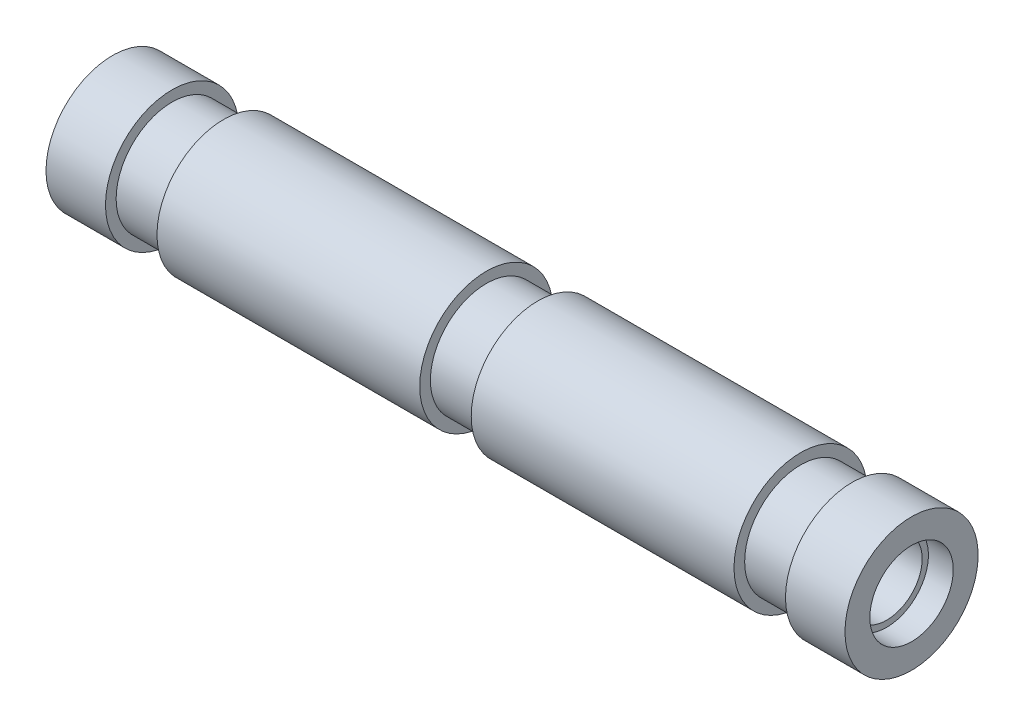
ISO-10303-21;
HEADER;
FILE_DESCRIPTION(('STEP AP214'),'2;1');
FILE_NAME('part.step','',(''),(''),'','','');
FILE_SCHEMA(('AUTOMOTIVE_DESIGN { 1 0 10303 214 1 1 1 1 }'));
ENDSEC;
DATA;
#1=APPLICATION_CONTEXT('core data for automotive mechanical design processes');
#2=APPLICATION_PROTOCOL_DEFINITION('international standard','automotive_design',2000,#1);
#3=PRODUCT_CONTEXT('',#1,'mechanical');
#4=PRODUCT('Part','Part','',(#3));
#5=PRODUCT_RELATED_PRODUCT_CATEGORY('part','',(#4));
#6=PRODUCT_DEFINITION_FORMATION('','',#4);
#7=PRODUCT_DEFINITION_CONTEXT('part definition',#1,'design');
#8=PRODUCT_DEFINITION('design','',#6,#7);
#9=PRODUCT_DEFINITION_SHAPE('','',#8);
#10=(LENGTH_UNIT() NAMED_UNIT(*) SI_UNIT(.MILLI.,.METRE.));
#11=(NAMED_UNIT(*) PLANE_ANGLE_UNIT() SI_UNIT($,.RADIAN.));
#12=(NAMED_UNIT(*) SI_UNIT($,.STERADIAN.) SOLID_ANGLE_UNIT());
#13=UNCERTAINTY_MEASURE_WITH_UNIT(LENGTH_MEASURE(1.E-05),#10,'distance_accuracy_value','');
#14=(GEOMETRIC_REPRESENTATION_CONTEXT(3) GLOBAL_UNCERTAINTY_ASSIGNED_CONTEXT((#13)) GLOBAL_UNIT_ASSIGNED_CONTEXT((#10,
#11,#12)) REPRESENTATION_CONTEXT('',''));
#15=CARTESIAN_POINT('',(0.,0.,0.));
#16=DIRECTION('',(0.,0.,1.));
#17=DIRECTION('',(1.,0.,0.));
#18=AXIS2_PLACEMENT_3D('',#15,#16,#17);
#19=CARTESIAN_POINT('',(-225.,37.5,0.));
#20=DIRECTION('',(1.,0.,0.));
#21=DIRECTION('',(0.,0.,-1.));
#22=AXIS2_PLACEMENT_3D('',#19,#20,#21);
#23=PLANE('',#22);
#24=CARTESIAN_POINT('',(-225.,0.,0.));
#25=DIRECTION('',(-1.,0.,0.));
#26=DIRECTION('',(0.,0.,1.));
#27=AXIS2_PLACEMENT_3D('',#24,#25,#26);
#28=CIRCLE('',#27,23.5);
#29=CARTESIAN_POINT('',(-225.,0.,23.5000000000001));
#30=VERTEX_POINT('',#29);
#31=EDGE_CURVE('E117',#30,#30,#28,.T.);
#32=ORIENTED_EDGE('',*,*,#31,.F.);
#33=EDGE_LOOP('',(#32));
#34=FACE_BOUND('',#33,.T.);
#35=CARTESIAN_POINT('',(-225.,0.,0.));
#36=DIRECTION('',(-1.,0.,0.));
#37=DIRECTION('',(0.,0.,1.));
#38=AXIS2_PLACEMENT_3D('',#35,#36,#37);
#39=CIRCLE('',#38,37.5);
#40=CARTESIAN_POINT('',(-225.,0.,37.5));
#41=VERTEX_POINT('',#40);
#42=EDGE_CURVE('E10',#41,#41,#39,.T.);
#43=ORIENTED_EDGE('',*,*,#42,.T.);
#44=EDGE_LOOP('',(#43));
#45=FACE_BOUND('',#44,.T.);
#46=ADVANCED_FACE('F34',(#34,#45),#23,.F.);
#47=CARTESIAN_POINT('',(-245.901988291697,0.,0.));
#48=DIRECTION('',(-1.,0.,0.));
#49=DIRECTION('',(0.,0.,1.));
#50=AXIS2_PLACEMENT_3D('',#47,#48,#49);
#51=CYLINDRICAL_SURFACE('',#50,37.5);
#52=ORIENTED_EDGE('',*,*,#42,.F.);
#53=EDGE_LOOP('',(#52));
#54=FACE_BOUND('',#53,.T.);
#55=CARTESIAN_POINT('',(-191.5,0.,0.));
#56=DIRECTION('',(-1.,0.,0.));
#57=DIRECTION('',(0.,0.,1.));
#58=AXIS2_PLACEMENT_3D('',#55,#56,#57);
#59=CIRCLE('',#58,37.5);
#60=CARTESIAN_POINT('',(-191.5,0.,37.5));
#61=VERTEX_POINT('',#60);
#62=EDGE_CURVE('E41',#61,#61,#59,.T.);
#63=ORIENTED_EDGE('',*,*,#62,.T.);
#64=EDGE_LOOP('',(#63));
#65=FACE_BOUND('',#64,.T.);
#66=ADVANCED_FACE('F125',(#54,#65),#51,.T.);
#67=CARTESIAN_POINT('',(-191.5,31.5,0.));
#68=DIRECTION('',(-1.,0.,0.));
#69=DIRECTION('',(0.,0.,1.));
#70=AXIS2_PLACEMENT_3D('',#67,#68,#69);
#71=PLANE('',#70);
#72=ORIENTED_EDGE('',*,*,#62,.F.);
#73=EDGE_LOOP('',(#72));
#74=FACE_BOUND('',#73,.T.);
#75=CARTESIAN_POINT('',(-191.5,0.,0.));
#76=DIRECTION('',(-1.,0.,0.));
#77=DIRECTION('',(0.,0.,1.));
#78=AXIS2_PLACEMENT_3D('',#75,#76,#77);
#79=CIRCLE('',#78,31.5);
#80=CARTESIAN_POINT('',(-191.5,0.,31.5));
#81=VERTEX_POINT('',#80);
#82=EDGE_CURVE('E47',#81,#81,#79,.T.);
#83=ORIENTED_EDGE('',*,*,#82,.T.);
#84=EDGE_LOOP('',(#83));
#85=FACE_BOUND('',#84,.T.);
#86=ADVANCED_FACE('F129',(#74,#85),#71,.F.);
#87=CARTESIAN_POINT('',(-245.901988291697,0.,0.));
#88=DIRECTION('',(-1.,0.,0.));
#89=DIRECTION('',(0.,0.,1.));
#90=AXIS2_PLACEMENT_3D('',#87,#88,#89);
#91=CYLINDRICAL_SURFACE('',#90,31.5);
#92=ORIENTED_EDGE('',*,*,#82,.F.);
#93=EDGE_LOOP('',(#92));
#94=FACE_BOUND('',#93,.T.);
#95=CARTESIAN_POINT('',(-162.5,0.,0.));
#96=DIRECTION('',(-1.,0.,0.));
#97=DIRECTION('',(0.,0.,1.));
#98=AXIS2_PLACEMENT_3D('',#95,#96,#97);
#99=CIRCLE('',#98,31.5);
#100=CARTESIAN_POINT('',(-162.5,0.,31.5));
#101=VERTEX_POINT('',#100);
#102=EDGE_CURVE('E53',#101,#101,#99,.T.);
#103=ORIENTED_EDGE('',*,*,#102,.T.);
#104=EDGE_LOOP('',(#103));
#105=FACE_BOUND('',#104,.T.);
#106=ADVANCED_FACE('F134',(#94,#105),#91,.T.);
#107=CARTESIAN_POINT('',(-162.5,37.5,0.));
#108=DIRECTION('',(1.,0.,0.));
#109=DIRECTION('',(0.,0.,-1.));
#110=AXIS2_PLACEMENT_3D('',#107,#108,#109);
#111=PLANE('',#110);
#112=ORIENTED_EDGE('',*,*,#102,.F.);
#113=EDGE_LOOP('',(#112));
#114=FACE_BOUND('',#113,.T.);
#115=CARTESIAN_POINT('',(-162.5,0.,0.));
#116=DIRECTION('',(-1.,0.,0.));
#117=DIRECTION('',(0.,0.,1.));
#118=AXIS2_PLACEMENT_3D('',#115,#116,#117);
#119=CIRCLE('',#118,37.5);
#120=CARTESIAN_POINT('',(-162.5,0.,37.5));
#121=VERTEX_POINT('',#120);
#122=EDGE_CURVE('E59',#121,#121,#119,.T.);
#123=ORIENTED_EDGE('',*,*,#122,.T.);
#124=EDGE_LOOP('',(#123));
#125=FACE_BOUND('',#124,.T.);
#126=ADVANCED_FACE('F140',(#114,#125),#111,.F.);
#127=CARTESIAN_POINT('',(-245.901988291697,0.,0.));
#128=DIRECTION('',(-1.,0.,0.));
#129=DIRECTION('',(0.,0.,1.));
#130=AXIS2_PLACEMENT_3D('',#127,#128,#129);
#131=CYLINDRICAL_SURFACE('',#130,37.5);
#132=ORIENTED_EDGE('',*,*,#122,.F.);
#133=EDGE_LOOP('',(#132));
#134=FACE_BOUND('',#133,.T.);
#135=CARTESIAN_POINT('',(-14.5,0.,0.));
#136=DIRECTION('',(-1.,0.,0.));
#137=DIRECTION('',(0.,0.,1.));
#138=AXIS2_PLACEMENT_3D('',#135,#136,#137);
#139=CIRCLE('',#138,37.5);
#140=CARTESIAN_POINT('',(-14.5,0.,37.5));
#141=VERTEX_POINT('',#140);
#142=EDGE_CURVE('E63',#141,#141,#139,.T.);
#143=ORIENTED_EDGE('',*,*,#142,.T.);
#144=EDGE_LOOP('',(#143));
#145=FACE_BOUND('',#144,.T.);
#146=ADVANCED_FACE('F144',(#134,#145),#131,.T.);
#147=CARTESIAN_POINT('',(-14.5,31.5,0.));
#148=DIRECTION('',(-1.,0.,0.));
#149=DIRECTION('',(0.,0.,1.));
#150=AXIS2_PLACEMENT_3D('',#147,#148,#149);
#151=PLANE('',#150);
#152=ORIENTED_EDGE('',*,*,#142,.F.);
#153=EDGE_LOOP('',(#152));
#154=FACE_BOUND('',#153,.T.);
#155=CARTESIAN_POINT('',(-14.5,0.,0.));
#156=DIRECTION('',(-1.,0.,0.));
#157=DIRECTION('',(0.,0.,1.));
#158=AXIS2_PLACEMENT_3D('',#155,#156,#157);
#159=CIRCLE('',#158,31.5);
#160=CARTESIAN_POINT('',(-14.5,0.,31.5));
#161=VERTEX_POINT('',#160);
#162=EDGE_CURVE('E67',#161,#161,#159,.T.);
#163=ORIENTED_EDGE('',*,*,#162,.T.);
#164=EDGE_LOOP('',(#163));
#165=FACE_BOUND('',#164,.T.);
#166=ADVANCED_FACE('F148',(#154,#165),#151,.F.);
#167=CARTESIAN_POINT('',(-245.901988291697,0.,0.));
#168=DIRECTION('',(-1.,0.,0.));
#169=DIRECTION('',(0.,0.,1.));
#170=AXIS2_PLACEMENT_3D('',#167,#168,#169);
#171=CYLINDRICAL_SURFACE('',#170,31.5);
#172=ORIENTED_EDGE('',*,*,#162,.F.);
#173=EDGE_LOOP('',(#172));
#174=FACE_BOUND('',#173,.T.);
#175=CARTESIAN_POINT('',(14.5,0.,0.));
#176=DIRECTION('',(-1.,0.,0.));
#177=DIRECTION('',(0.,0.,1.));
#178=AXIS2_PLACEMENT_3D('',#175,#176,#177);
#179=CIRCLE('',#178,31.5);
#180=CARTESIAN_POINT('',(14.5,0.,31.5));
#181=VERTEX_POINT('',#180);
#182=EDGE_CURVE('E71',#181,#181,#179,.T.);
#183=ORIENTED_EDGE('',*,*,#182,.T.);
#184=EDGE_LOOP('',(#183));
#185=FACE_BOUND('',#184,.T.);
#186=ADVANCED_FACE('F152',(#174,#185),#171,.T.);
#187=CARTESIAN_POINT('',(14.5,37.5,0.));
#188=DIRECTION('',(1.,0.,0.));
#189=DIRECTION('',(0.,0.,-1.));
#190=AXIS2_PLACEMENT_3D('',#187,#188,#189);
#191=PLANE('',#190);
#192=ORIENTED_EDGE('',*,*,#182,.F.);
#193=EDGE_LOOP('',(#192));
#194=FACE_BOUND('',#193,.T.);
#195=CARTESIAN_POINT('',(14.5,0.,0.));
#196=DIRECTION('',(-1.,0.,0.));
#197=DIRECTION('',(0.,0.,1.));
#198=AXIS2_PLACEMENT_3D('',#195,#196,#197);
#199=CIRCLE('',#198,37.5);
#200=CARTESIAN_POINT('',(14.5,0.,37.5));
#201=VERTEX_POINT('',#200);
#202=EDGE_CURVE('E75',#201,#201,#199,.T.);
#203=ORIENTED_EDGE('',*,*,#202,.T.);
#204=EDGE_LOOP('',(#203));
#205=FACE_BOUND('',#204,.T.);
#206=ADVANCED_FACE('F156',(#194,#205),#191,.F.);
#207=CARTESIAN_POINT('',(-245.901988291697,0.,0.));
#208=DIRECTION('',(-1.,0.,0.));
#209=DIRECTION('',(0.,0.,1.));
#210=AXIS2_PLACEMENT_3D('',#207,#208,#209);
#211=CYLINDRICAL_SURFACE('',#210,37.5);
#212=ORIENTED_EDGE('',*,*,#202,.F.);
#213=EDGE_LOOP('',(#212));
#214=FACE_BOUND('',#213,.T.);
#215=CARTESIAN_POINT('',(162.5,0.,0.));
#216=DIRECTION('',(-1.,0.,0.));
#217=DIRECTION('',(0.,0.,1.));
#218=AXIS2_PLACEMENT_3D('',#215,#216,#217);
#219=CIRCLE('',#218,37.5);
#220=CARTESIAN_POINT('',(162.5,0.,37.5));
#221=VERTEX_POINT('',#220);
#222=EDGE_CURVE('E79',#221,#221,#219,.T.);
#223=ORIENTED_EDGE('',*,*,#222,.T.);
#224=EDGE_LOOP('',(#223));
#225=FACE_BOUND('',#224,.T.);
#226=ADVANCED_FACE('F160',(#214,#225),#211,.T.);
#227=CARTESIAN_POINT('',(162.5,31.5,0.));
#228=DIRECTION('',(-1.,0.,0.));
#229=DIRECTION('',(0.,0.,1.));
#230=AXIS2_PLACEMENT_3D('',#227,#228,#229);
#231=PLANE('',#230);
#232=ORIENTED_EDGE('',*,*,#222,.F.);
#233=EDGE_LOOP('',(#232));
#234=FACE_BOUND('',#233,.T.);
#235=CARTESIAN_POINT('',(162.5,0.,0.));
#236=DIRECTION('',(-1.,0.,0.));
#237=DIRECTION('',(0.,0.,1.));
#238=AXIS2_PLACEMENT_3D('',#235,#236,#237);
#239=CIRCLE('',#238,31.5);
#240=CARTESIAN_POINT('',(162.5,0.,31.5000000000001));
#241=VERTEX_POINT('',#240);
#242=EDGE_CURVE('E82',#241,#241,#239,.T.);
#243=ORIENTED_EDGE('',*,*,#242,.T.);
#244=EDGE_LOOP('',(#243));
#245=FACE_BOUND('',#244,.T.);
#246=ADVANCED_FACE('F164',(#234,#245),#231,.F.);
#247=CARTESIAN_POINT('',(-245.901988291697,0.,0.));
#248=DIRECTION('',(-1.,0.,0.));
#249=DIRECTION('',(0.,0.,1.));
#250=AXIS2_PLACEMENT_3D('',#247,#248,#249);
#251=CYLINDRICAL_SURFACE('',#250,31.5);
#252=ORIENTED_EDGE('',*,*,#242,.F.);
#253=EDGE_LOOP('',(#252));
#254=FACE_BOUND('',#253,.T.);
#255=CARTESIAN_POINT('',(191.5,0.,0.));
#256=DIRECTION('',(-1.,0.,0.));
#257=DIRECTION('',(0.,0.,1.));
#258=AXIS2_PLACEMENT_3D('',#255,#256,#257);
#259=CIRCLE('',#258,31.5);
#260=CARTESIAN_POINT('',(191.5,0.,31.5000000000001));
#261=VERTEX_POINT('',#260);
#262=EDGE_CURVE('E86',#261,#261,#259,.T.);
#263=ORIENTED_EDGE('',*,*,#262,.T.);
#264=EDGE_LOOP('',(#263));
#265=FACE_BOUND('',#264,.T.);
#266=ADVANCED_FACE('F168',(#254,#265),#251,.T.);
#267=CARTESIAN_POINT('',(191.5,37.5,0.));
#268=DIRECTION('',(1.,0.,0.));
#269=DIRECTION('',(0.,0.,-1.));
#270=AXIS2_PLACEMENT_3D('',#267,#268,#269);
#271=PLANE('',#270);
#272=ORIENTED_EDGE('',*,*,#262,.F.);
#273=EDGE_LOOP('',(#272));
#274=FACE_BOUND('',#273,.T.);
#275=CARTESIAN_POINT('',(191.5,0.,0.));
#276=DIRECTION('',(-1.,0.,0.));
#277=DIRECTION('',(0.,0.,1.));
#278=AXIS2_PLACEMENT_3D('',#275,#276,#277);
#279=CIRCLE('',#278,37.5);
#280=CARTESIAN_POINT('',(191.5,0.,37.5000000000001));
#281=VERTEX_POINT('',#280);
#282=EDGE_CURVE('E90',#281,#281,#279,.T.);
#283=ORIENTED_EDGE('',*,*,#282,.T.);
#284=EDGE_LOOP('',(#283));
#285=FACE_BOUND('',#284,.T.);
#286=ADVANCED_FACE('F172',(#274,#285),#271,.F.);
#287=CARTESIAN_POINT('',(-245.901988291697,0.,0.));
#288=DIRECTION('',(-1.,0.,0.));
#289=DIRECTION('',(0.,0.,1.));
#290=AXIS2_PLACEMENT_3D('',#287,#288,#289);
#291=CYLINDRICAL_SURFACE('',#290,37.5);
#292=ORIENTED_EDGE('',*,*,#282,.F.);
#293=EDGE_LOOP('',(#292));
#294=FACE_BOUND('',#293,.T.);
#295=CARTESIAN_POINT('',(225.,0.,0.));
#296=DIRECTION('',(-1.,0.,0.));
#297=DIRECTION('',(0.,0.,1.));
#298=AXIS2_PLACEMENT_3D('',#295,#296,#297);
#299=CIRCLE('',#298,37.5);
#300=CARTESIAN_POINT('',(225.,0.,37.5000000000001));
#301=VERTEX_POINT('',#300);
#302=EDGE_CURVE('E94',#301,#301,#299,.T.);
#303=ORIENTED_EDGE('',*,*,#302,.T.);
#304=EDGE_LOOP('',(#303));
#305=FACE_BOUND('',#304,.T.);
#306=ADVANCED_FACE('F176',(#294,#305),#291,.T.);
#307=CARTESIAN_POINT('',(225.,23.5,0.));
#308=DIRECTION('',(-1.,0.,0.));
#309=DIRECTION('',(0.,0.,1.));
#310=AXIS2_PLACEMENT_3D('',#307,#308,#309);
#311=PLANE('',#310);
#312=ORIENTED_EDGE('',*,*,#302,.F.);
#313=EDGE_LOOP('',(#312));
#314=FACE_BOUND('',#313,.T.);
#315=CARTESIAN_POINT('',(225.,0.,0.));
#316=DIRECTION('',(-1.,0.,0.));
#317=DIRECTION('',(0.,0.,1.));
#318=AXIS2_PLACEMENT_3D('',#315,#316,#317);
#319=CIRCLE('',#318,23.5);
#320=CARTESIAN_POINT('',(225.,0.,23.5));
#321=VERTEX_POINT('',#320);
#322=EDGE_CURVE('E98',#321,#321,#319,.T.);
#323=ORIENTED_EDGE('',*,*,#322,.T.);
#324=EDGE_LOOP('',(#323));
#325=FACE_BOUND('',#324,.T.);
#326=ADVANCED_FACE('F180',(#314,#325),#311,.F.);
#327=CARTESIAN_POINT('',(-245.901988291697,0.,0.));
#328=DIRECTION('',(-1.,0.,0.));
#329=DIRECTION('',(0.,0.,1.));
#330=AXIS2_PLACEMENT_3D('',#327,#328,#329);
#331=CYLINDRICAL_SURFACE('',#330,23.5);
#332=ORIENTED_EDGE('',*,*,#322,.F.);
#333=EDGE_LOOP('',(#332));
#334=FACE_BOUND('',#333,.T.);
#335=CARTESIAN_POINT('',(211.,0.,0.));
#336=DIRECTION('',(-1.,0.,0.));
#337=DIRECTION('',(0.,0.,1.));
#338=AXIS2_PLACEMENT_3D('',#335,#336,#337);
#339=CIRCLE('',#338,23.5);
#340=CARTESIAN_POINT('',(211.,0.,23.5));
#341=VERTEX_POINT('',#340);
#342=EDGE_CURVE('E101',#341,#341,#339,.T.);
#343=ORIENTED_EDGE('',*,*,#342,.T.);
#344=EDGE_LOOP('',(#343));
#345=FACE_BOUND('',#344,.T.);
#346=ADVANCED_FACE('F184',(#334,#345),#331,.F.);
#347=CARTESIAN_POINT('',(211.,20.,0.));
#348=DIRECTION('',(-1.,0.,0.));
#349=DIRECTION('',(0.,0.,1.));
#350=AXIS2_PLACEMENT_3D('',#347,#348,#349);
#351=PLANE('',#350);
#352=ORIENTED_EDGE('',*,*,#342,.F.);
#353=EDGE_LOOP('',(#352));
#354=FACE_BOUND('',#353,.T.);
#355=CARTESIAN_POINT('',(211.,0.,0.));
#356=DIRECTION('',(-1.,0.,0.));
#357=DIRECTION('',(0.,0.,1.));
#358=AXIS2_PLACEMENT_3D('',#355,#356,#357);
#359=CIRCLE('',#358,20.);
#360=CARTESIAN_POINT('',(211.,0.,20.));
#361=VERTEX_POINT('',#360);
#362=EDGE_CURVE('E105',#361,#361,#359,.T.);
#363=ORIENTED_EDGE('',*,*,#362,.T.);
#364=EDGE_LOOP('',(#363));
#365=FACE_BOUND('',#364,.T.);
#366=ADVANCED_FACE('F188',(#354,#365),#351,.F.);
#367=CARTESIAN_POINT('',(-245.901988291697,0.,0.));
#368=DIRECTION('',(-1.,0.,0.));
#369=DIRECTION('',(0.,0.,1.));
#370=AXIS2_PLACEMENT_3D('',#367,#368,#369);
#371=CYLINDRICAL_SURFACE('',#370,20.);
#372=ORIENTED_EDGE('',*,*,#362,.F.);
#373=EDGE_LOOP('',(#372));
#374=FACE_BOUND('',#373,.T.);
#375=CARTESIAN_POINT('',(-211.,0.,0.));
#376=DIRECTION('',(-1.,0.,0.));
#377=DIRECTION('',(0.,0.,1.));
#378=AXIS2_PLACEMENT_3D('',#375,#376,#377);
#379=CIRCLE('',#378,20.);
#380=CARTESIAN_POINT('',(-211.,0.,20.));
#381=VERTEX_POINT('',#380);
#382=EDGE_CURVE('E109',#381,#381,#379,.T.);
#383=ORIENTED_EDGE('',*,*,#382,.T.);
#384=EDGE_LOOP('',(#383));
#385=FACE_BOUND('',#384,.T.);
#386=ADVANCED_FACE('F192',(#374,#385),#371,.F.);
#387=CARTESIAN_POINT('',(-211.,23.5,0.));
#388=DIRECTION('',(1.,0.,0.));
#389=DIRECTION('',(0.,0.,-1.));
#390=AXIS2_PLACEMENT_3D('',#387,#388,#389);
#391=PLANE('',#390);
#392=ORIENTED_EDGE('',*,*,#382,.F.);
#393=EDGE_LOOP('',(#392));
#394=FACE_BOUND('',#393,.T.);
#395=CARTESIAN_POINT('',(-211.,0.,0.));
#396=DIRECTION('',(-1.,0.,0.));
#397=DIRECTION('',(0.,0.,1.));
#398=AXIS2_PLACEMENT_3D('',#395,#396,#397);
#399=CIRCLE('',#398,23.5);
#400=CARTESIAN_POINT('',(-211.,0.,23.5));
#401=VERTEX_POINT('',#400);
#402=EDGE_CURVE('E113',#401,#401,#399,.T.);
#403=ORIENTED_EDGE('',*,*,#402,.T.);
#404=EDGE_LOOP('',(#403));
#405=FACE_BOUND('',#404,.T.);
#406=ADVANCED_FACE('F196',(#394,#405),#391,.F.);
#407=CARTESIAN_POINT('',(-245.901988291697,0.,0.));
#408=DIRECTION('',(-1.,0.,0.));
#409=DIRECTION('',(0.,0.,1.));
#410=AXIS2_PLACEMENT_3D('',#407,#408,#409);
#411=CYLINDRICAL_SURFACE('',#410,23.5);
#412=ORIENTED_EDGE('',*,*,#402,.F.);
#413=EDGE_LOOP('',(#412));
#414=FACE_BOUND('',#413,.T.);
#415=ORIENTED_EDGE('',*,*,#31,.T.);
#416=EDGE_LOOP('',(#415));
#417=FACE_BOUND('',#416,.T.);
#418=ADVANCED_FACE('F122',(#414,#417),#411,.F.);
#419=CLOSED_SHELL('',(#46,#66,#86,#106,#126,#146,#166,#186,#206,#226,#246,#266,#286,#306,#326,
#346,#366,#386,#406,#418));
#420=MANIFOLD_SOLID_BREP('B2',#419);
#421=ADVANCED_BREP_SHAPE_REPRESENTATION('',(#18,#420),#14);
#422=SHAPE_DEFINITION_REPRESENTATION(#9,#421);
ENDSEC;
END-ISO-10303-21;
